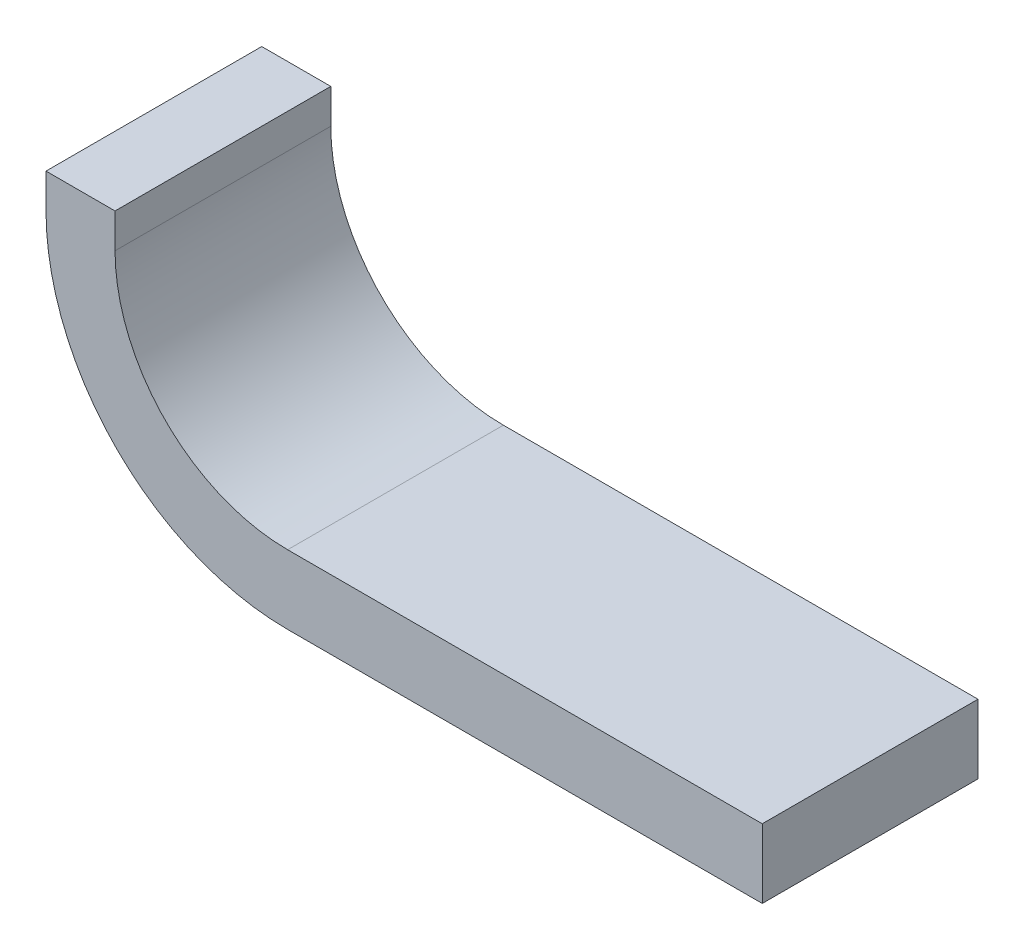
from build123d import *

# Parameters (mm, degrees)
EXTRUSION1_DEPTH = 25


with BuildPart() as part:
    # Esquisse1 → Extrusion1 (new body)
    with BuildSketch(Plane.XY):
        with BuildLine():
            Line((0, 0), (-55, 0))
            ThreePointArc((-55, 0), (-74.798989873, 8.201010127), (-83, 28))
            Line((-83, 28), (-83, 32))
            Line((-83, 32), (-75, 32))
            Line((-75, 32), (-75, 28))
            ThreePointArc((-75, 28), (-69.142135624, 13.857864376), (-55, 8))
            Line((-55, 8), (0, 8))
            Line((0, 8), (0, 0))
        make_face()
    extrude(amount=EXTRUSION1_DEPTH)


solid = part.part
